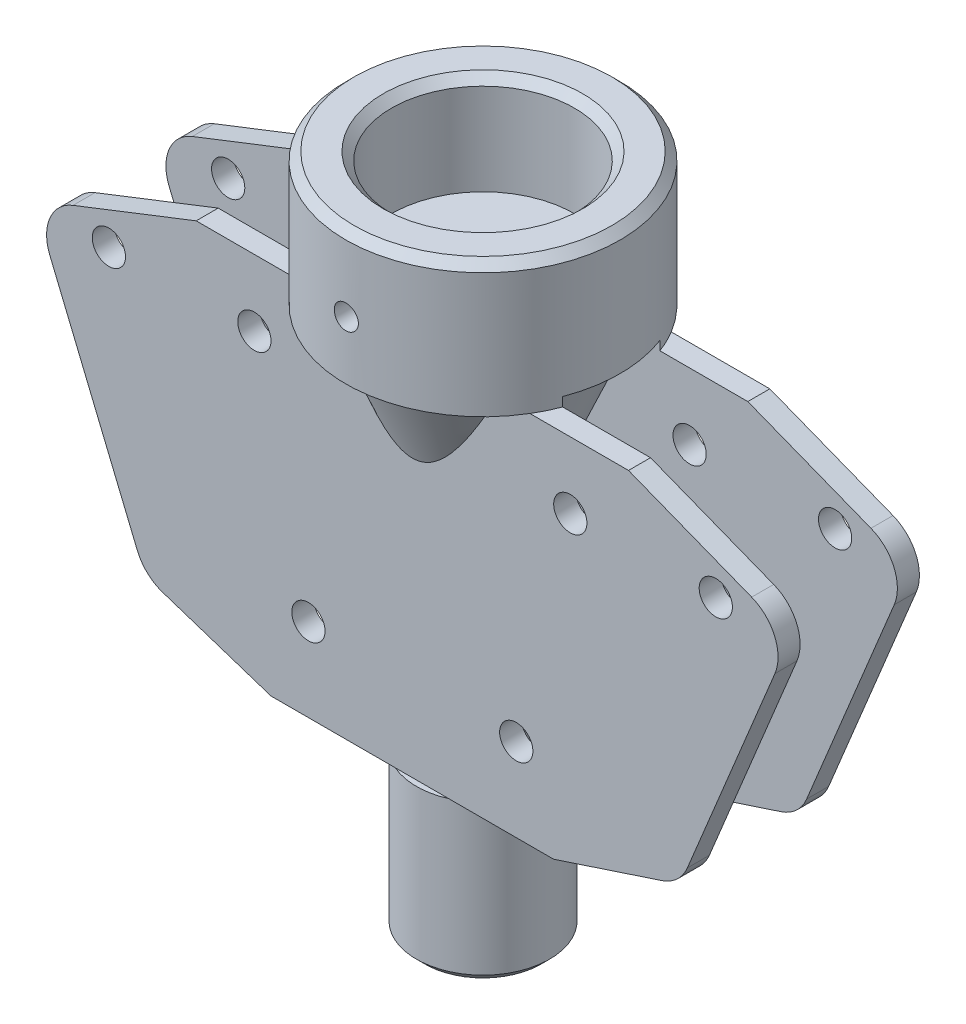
from build123d import *

# Parameters (mm, degrees)
BASE_EXTRUSION_DEPTH    = 17
CONG_1_R                = 5
ESQUISSE5_R             = 16.5
BOSS_EXTRU_1_DEPTH      = 16
ENL_V_START             = -43.991208
ESQUISSE9_W             = 11.7
ESQUISSE9_H             = 51.405339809
ENL_V_MAT_EXTRU_2_DEPTH = 87.982416
ESQUISSE15_R            = 6
BOSS_EXTRU_2_DEPTH      = 26
ESQUISSE16_R            = 8
BOSS_EXTRU_3_DEPTH      = 19
CHANFREIN1_SIZE         = 1
ESQUISSE17_R            = 2
ENL_V_MAT_EXTRU_3_DEPTH = 80.254188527
ESQUISSE18_R            = 11
ENL_V_MAT_EXTRU_4_DEPTH = 12
ESQUISSE19_R            = 4.5
ENL_V_MAT_EXTRU_5_DEPTH = 82
CHANFREIN2_SIZE         = 1
CHANFREIN3_SIZE         = 1
ESQUISSE23_W            = 1.45
ESQUISSE23_H            = 25


with BuildPart() as part:
    # Esquisse1 → Base-Extrusion (new body)
    with BuildSketch(Plane.XY):
        Polygon((-17, 0), (17, 0), (32.198684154, 5), (45.557198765, 37.350426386), (26, 45), (-26, 45), (-45.557198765, 37.350426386), (-32.198684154, 5), align=None)
    extrude(amount=BASE_EXTRUSION_DEPTH)

    # Cong_1
    cong_1_edges = [part.edges().sort_by_distance(p)[0] for p in [
        (45.557198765, 37.350426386, 8.5),
        (32.198684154, 5, 8.5),
        (-32.198684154, 5, 8.5),
        (-45.557198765, 37.350426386, 8.5),
    ]]
    fillet(cong_1_edges, radius=CONG_1_R)

    # Esquisse5 → Boss.-Extru.1 (add)
    with BuildSketch(Plane(origin=(0, 45, 0), x_dir=(-1, 0, 0), z_dir=(0, 1, 0))):
        with Locations(Location((0, 8.5, 0), (0, 0, 211.007583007))):
            Circle(ESQUISSE5_R)
    extrude(amount=BOSS_EXTRU_1_DEPTH)

    # Esquisse9 → Enl_v. mat.-Extru.2 (cut)
    with BuildSketch(Plane(origin=(0, 0, 0), x_dir=(0, 0, -1), z_dir=(1, 0, 0)).offset(ENL_V_START)):
        with Locations((-8.5, 20.378761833)):
            Rectangle(ESQUISSE9_W, ESQUISSE9_H)
    extrude(amount=ENL_V_MAT_EXTRU_2_DEPTH, mode=Mode.SUBTRACT)

    # Esquisse14 → Boss.-R_vol.1 (revolve)
    with BuildSketch(Plane(origin=(0, 0, 0), x_dir=(0, 0, -1), z_dir=(1, 0, 0))):
        Polygon((-8.5, 45.740204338), (-22.261709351, 45.740204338), (-13.428527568, 24.827476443), (-8.5, 24.827476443), align=None)
    revolve(axis=Axis((0, 54.838113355, 8.5), (0, -1, 0)))

    # Esquisse15 → Boss.-Extru.2 (add)
    with BuildSketch(Plane.XZ.offset(-24.827476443)):
        with Locations(Location((0, 8.5, 0), (0, 0, 77.161431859))):
            Circle(ESQUISSE15_R)
    extrude(amount=BOSS_EXTRU_2_DEPTH)

    # Esquisse16 → Boss.-Extru.3 (add)
    with BuildSketch(Plane.XZ.offset(1.172523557)):
        with Locations(Location((0, 8.5, 0), (0, 0, 270))):
            Circle(ESQUISSE16_R)
    extrude(amount=BOSS_EXTRU_3_DEPTH)

    # Chanfrein1
    chanfrein1_edges = [part.edges().sort_by_distance(p)[0] for p in [
        (0, -20.172523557, 16.5),
    ]]
    chamfer(chanfrein1_edges, length=CHANFREIN1_SIZE)

    # Esquisse17 → Enl_v. mat.-Extru.3 (cut, through all)
    with BuildSketch(Plane.XY.offset(17)):
        with Locations((-36.5, 37)):
            Circle(ESQUISSE17_R)
        with Locations((-19, 37)):
            Circle(ESQUISSE17_R)
        with Locations((-12.5, 10)):
            Circle(ESQUISSE17_R)
        with Locations((12.5, 10)):
            Circle(ESQUISSE17_R)
        with Locations((19, 37)):
            Circle(ESQUISSE17_R)
        with Locations((36.5, 37)):
            Circle(ESQUISSE17_R)
    extrude(amount=-ENL_V_MAT_EXTRU_3_DEPTH, mode=Mode.SUBTRACT)

    # Esquisse18 → Enl_v. mat.-Extru.4 (cut)
    with BuildSketch(Plane(origin=(0, 61, 0), x_dir=(-1, 0, 0), z_dir=(0, 1, 0))):
        with Locations(Location((0, 8.5, 0), (0, 0, 90))):
            Circle(ESQUISSE18_R)
    extrude(amount=-ENL_V_MAT_EXTRU_4_DEPTH, mode=Mode.SUBTRACT)

    # Esquisse19 → Enl_v. mat.-Extru.5 (cut)
    with BuildSketch(Plane(origin=(0, 49, 0), x_dir=(-1, 0, 0), z_dir=(0, 1, 0))):
        with Locations(Location((0, 8.5, 0), (0, 0, 90))):
            Circle(ESQUISSE19_R)
    extrude(amount=-ENL_V_MAT_EXTRU_5_DEPTH, mode=Mode.SUBTRACT)

    # Chanfrein2
    chanfrein2_edges = [part.edges().sort_by_distance(p)[0] for p in [
        (0, 61, -2.5),
    ]]
    chamfer(chanfrein2_edges, length=CHANFREIN2_SIZE)

    # Chanfrein3
    chanfrein3_edges = [part.edges().sort_by_distance(p)[0] for p in [
        (-14.142135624, 61, 17),
    ]]
    chamfer(chanfrein3_edges, length=CHANFREIN3_SIZE)

    # Esquisse23 → Trou taraud_ M3.5x0.61 (revolve, cut)
    with BuildSketch(Plane(origin=(0, 52, 0), x_dir=(0, 1, 0), z_dir=(1, 0, 0))):
        with Locations((0.725, 12.5)):
            Rectangle(ESQUISSE23_W, ESQUISSE23_H)
    revolve(axis=Axis((0, 52, -6.35), (0, 0, 1)), mode=Mode.SUBTRACT)


solid = part.part
